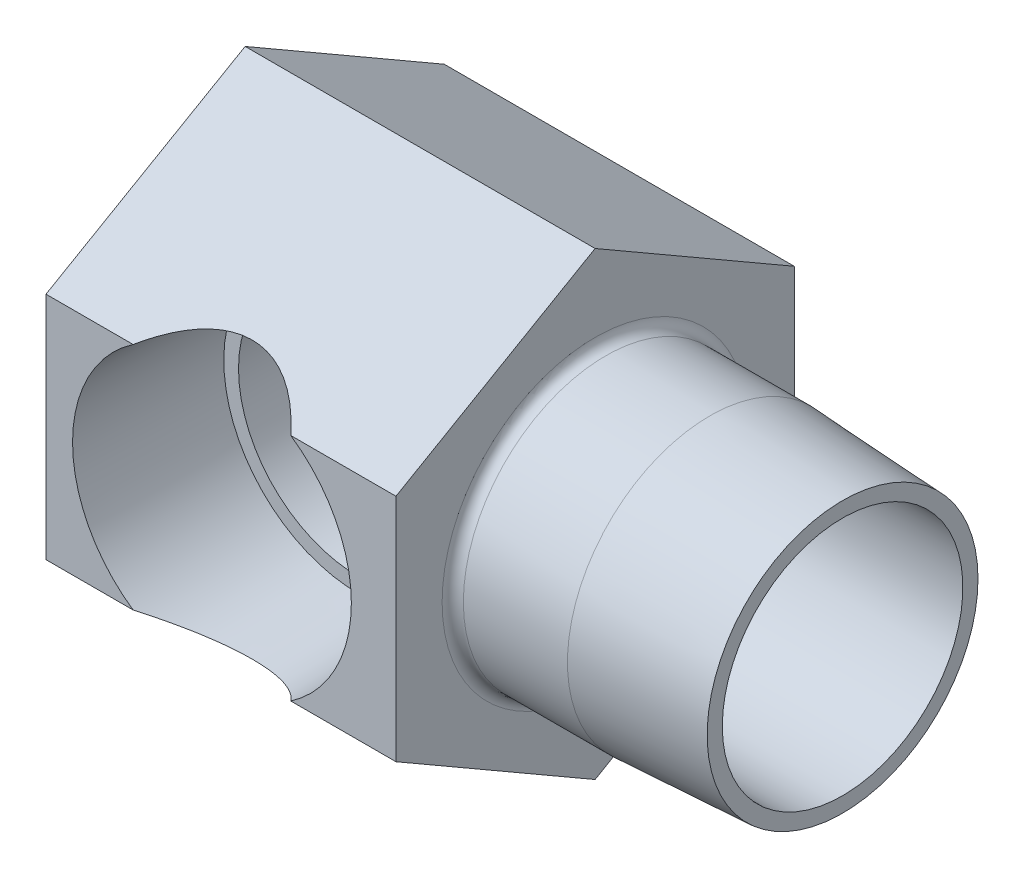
ISO-10303-21;
HEADER;
FILE_DESCRIPTION(('STEP AP214'),'2;1');
FILE_NAME('part.step','',(''),(''),'','','');
FILE_SCHEMA(('AUTOMOTIVE_DESIGN { 1 0 10303 214 1 1 1 1 }'));
ENDSEC;
DATA;
#1=APPLICATION_CONTEXT('core data for automotive mechanical design processes');
#2=APPLICATION_PROTOCOL_DEFINITION('international standard','automotive_design',2000,#1);
#3=PRODUCT_CONTEXT('',#1,'mechanical');
#4=PRODUCT('Part','Part','',(#3));
#5=PRODUCT_RELATED_PRODUCT_CATEGORY('part','',(#4));
#6=PRODUCT_DEFINITION_FORMATION('','',#4);
#7=PRODUCT_DEFINITION_CONTEXT('part definition',#1,'design');
#8=PRODUCT_DEFINITION('design','',#6,#7);
#9=PRODUCT_DEFINITION_SHAPE('','',#8);
#10=(LENGTH_UNIT() NAMED_UNIT(*) SI_UNIT(.MILLI.,.METRE.));
#11=(NAMED_UNIT(*) PLANE_ANGLE_UNIT() SI_UNIT($,.RADIAN.));
#12=(NAMED_UNIT(*) SI_UNIT($,.STERADIAN.) SOLID_ANGLE_UNIT());
#13=UNCERTAINTY_MEASURE_WITH_UNIT(LENGTH_MEASURE(1.E-05),#10,'distance_accuracy_value','');
#14=(GEOMETRIC_REPRESENTATION_CONTEXT(3) GLOBAL_UNCERTAINTY_ASSIGNED_CONTEXT((#13)) GLOBAL_UNIT_ASSIGNED_CONTEXT((#10,
#11,#12)) REPRESENTATION_CONTEXT('',''));
#15=CARTESIAN_POINT('',(0.,0.,0.));
#16=DIRECTION('',(0.,0.,1.));
#17=DIRECTION('',(1.,0.,0.));
#18=AXIS2_PLACEMENT_3D('',#15,#16,#17);
#19=CARTESIAN_POINT('',(-44.45,10.9985226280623,19.05));
#20=DIRECTION('',(0.,0.,1.));
#21=DIRECTION('',(0.,-1.,0.));
#22=AXIS2_PLACEMENT_3D('',#19,#20,#21);
#23=PLANE('',#22);
#24=CARTESIAN_POINT('',(-28.575,-1.20882374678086E-13,19.05));
#25=DIRECTION('',(0.,0.,1.));
#26=DIRECTION('',(0.,-1.,0.));
#27=AXIS2_PLACEMENT_3D('',#24,#25,#26);
#28=CIRCLE('',#27,13.3347714);
#29=CARTESIAN_POINT('',(-21.0351970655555,-10.9985226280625,19.05));
#30=VERTEX_POINT('',#29);
#31=CARTESIAN_POINT('',(-21.0351970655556,10.9985226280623,19.05));
#32=VERTEX_POINT('',#31);
#33=EDGE_CURVE('E255',#30,#32,#28,.T.);
#34=ORIENTED_EDGE('',*,*,#33,.F.);
#35=DIRECTION('',(1.,0.,0.));
#36=VECTOR('',#35,1.);
#37=CARTESIAN_POINT('',(-44.45,-10.9985226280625,19.05));
#38=LINE('',#37,#36);
#39=CARTESIAN_POINT('',(-10.9728,-10.9985226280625,19.05));
#40=VERTEX_POINT('',#39);
#41=EDGE_CURVE('E193',#30,#40,#38,.T.);
#42=ORIENTED_EDGE('',*,*,#41,.T.);
#43=DIRECTION('',(0.,-1.,0.));
#44=VECTOR('',#43,1.);
#45=CARTESIAN_POINT('',(-10.9728,10.9985226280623,19.05));
#46=LINE('',#45,#44);
#47=CARTESIAN_POINT('',(-10.9728,10.9985226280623,19.05));
#48=VERTEX_POINT('',#47);
#49=EDGE_CURVE('E220',#48,#40,#46,.T.);
#50=ORIENTED_EDGE('',*,*,#49,.F.);
#51=DIRECTION('',(1.,0.,0.));
#52=VECTOR('',#51,1.);
#53=CARTESIAN_POINT('',(-44.45,10.9985226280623,19.05));
#54=LINE('',#53,#52);
#55=EDGE_CURVE('E201',#32,#48,#54,.T.);
#56=ORIENTED_EDGE('',*,*,#55,.F.);
#57=EDGE_LOOP('',(#34,#42,#50,#56));
#58=FACE_BOUND('',#57,.T.);
#59=ADVANCED_FACE('F14',(#58),#23,.T.);
#60=CARTESIAN_POINT('',(-36.1148029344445,10.9985226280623,19.05));
#61=VERTEX_POINT('',#60);
#62=CARTESIAN_POINT('',(-36.1148029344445,-10.9985226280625,19.05));
#63=VERTEX_POINT('',#62);
#64=EDGE_CURVE('E37',#61,#63,#28,.T.);
#65=ORIENTED_EDGE('',*,*,#64,.F.);
#66=CARTESIAN_POINT('',(-44.45,10.9985226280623,19.05));
#67=VERTEX_POINT('',#66);
#68=EDGE_CURVE('E188',#67,#61,#54,.T.);
#69=ORIENTED_EDGE('',*,*,#68,.F.);
#70=DIRECTION('',(0.,-1.,0.));
#71=VECTOR('',#70,1.);
#72=CARTESIAN_POINT('',(-44.45,10.9985226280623,19.05));
#73=LINE('',#72,#71);
#74=CARTESIAN_POINT('',(-44.45,-10.9985226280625,19.05));
#75=VERTEX_POINT('',#74);
#76=EDGE_CURVE('E207',#67,#75,#73,.T.);
#77=ORIENTED_EDGE('',*,*,#76,.T.);
#78=EDGE_CURVE('E189',#75,#63,#38,.T.);
#79=ORIENTED_EDGE('',*,*,#78,.T.);
#80=EDGE_LOOP('',(#65,#69,#77,#79));
#81=FACE_BOUND('',#80,.T.);
#82=ADVANCED_FACE('F287',(#81),#23,.T.);
#83=CARTESIAN_POINT('',(-44.45,21.9970452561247,1.53604546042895E-13));
#84=DIRECTION('',(0.,0.866025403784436,0.500000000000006));
#85=DIRECTION('',(0.,-0.500000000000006,0.866025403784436));
#86=AXIS2_PLACEMENT_3D('',#83,#84,#85);
#87=PLANE('',#86);
#88=CARTESIAN_POINT('',(-28.575,-0.7230648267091,39.3523850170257));
#89=DIRECTION('',(0.,0.866025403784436,0.500000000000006));
#90=DIRECTION('',(0.,-0.500000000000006,0.866025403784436));
#91=AXIS2_PLACEMENT_3D('',#88,#89,#90);
#92=ELLIPSE('',#91,27.885303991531,13.9238903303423);
#93=EDGE_CURVE('E246',#32,#61,#92,.T.);
#94=ORIENTED_EDGE('',*,*,#93,.F.);
#95=ORIENTED_EDGE('',*,*,#55,.T.);
#96=DIRECTION('',(0.,-0.500000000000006,0.866025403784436));
#97=VECTOR('',#96,1.);
#98=CARTESIAN_POINT('',(-10.9728,21.9970452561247,1.53604546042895E-13));
#99=LINE('',#98,#97);
#100=CARTESIAN_POINT('',(-10.9728,21.9970452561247,1.53604546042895E-13));
#101=VERTEX_POINT('',#100);
#102=EDGE_CURVE('E204',#101,#48,#99,.T.);
#103=ORIENTED_EDGE('',*,*,#102,.F.);
#104=DIRECTION('',(1.,0.,0.));
#105=VECTOR('',#104,1.);
#106=CARTESIAN_POINT('',(-44.45,21.9970452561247,1.53604546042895E-13));
#107=LINE('',#106,#105);
#108=CARTESIAN_POINT('',(-44.45,21.9970452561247,1.53604546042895E-13));
#109=VERTEX_POINT('',#108);
#110=EDGE_CURVE('E199',#109,#101,#107,.T.);
#111=ORIENTED_EDGE('',*,*,#110,.F.);
#112=DIRECTION('',(0.,-0.500000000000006,0.866025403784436));
#113=VECTOR('',#112,1.);
#114=CARTESIAN_POINT('',(-44.45,21.9970452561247,1.53604546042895E-13));
#115=LINE('',#114,#113);
#116=EDGE_CURVE('E224',#109,#67,#115,.T.);
#117=ORIENTED_EDGE('',*,*,#116,.T.);
#118=ORIENTED_EDGE('',*,*,#68,.T.);
#119=EDGE_LOOP('',(#94,#95,#103,#111,#117,#118));
#120=FACE_BOUND('',#119,.T.);
#121=ADVANCED_FACE('F293',(#120),#87,.T.);
#122=CARTESIAN_POINT('',(-44.45,10.9985226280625,-19.05));
#123=DIRECTION('',(0.,0.866025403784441,-0.499999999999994));
#124=DIRECTION('',(0.,0.499999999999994,0.866025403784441));
#125=AXIS2_PLACEMENT_3D('',#122,#123,#124);
#126=PLANE('',#125);
#127=DIRECTION('',(0.,0.499999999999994,0.866025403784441));
#128=VECTOR('',#127,1.);
#129=CARTESIAN_POINT('',(-10.9728,10.9985226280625,-19.05));
#130=LINE('',#129,#128);
#131=CARTESIAN_POINT('',(-10.9728,10.9985226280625,-19.05));
#132=VERTEX_POINT('',#131);
#133=EDGE_CURVE('E208',#132,#101,#130,.T.);
#134=ORIENTED_EDGE('',*,*,#133,.F.);
#135=DIRECTION('',(1.,0.,0.));
#136=VECTOR('',#135,1.);
#137=CARTESIAN_POINT('',(-44.45,10.9985226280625,-19.05));
#138=LINE('',#137,#136);
#139=CARTESIAN_POINT('',(-44.45,10.9985226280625,-19.05));
#140=VERTEX_POINT('',#139);
#141=EDGE_CURVE('E197',#140,#132,#138,.T.);
#142=ORIENTED_EDGE('',*,*,#141,.F.);
#143=DIRECTION('',(0.,0.499999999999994,0.866025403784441));
#144=VECTOR('',#143,1.);
#145=CARTESIAN_POINT('',(-44.45,10.9985226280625,-19.05));
#146=LINE('',#145,#144);
#147=EDGE_CURVE('E227',#140,#109,#146,.T.);
#148=ORIENTED_EDGE('',*,*,#147,.T.);
#149=ORIENTED_EDGE('',*,*,#110,.T.);
#150=EDGE_LOOP('',(#134,#142,#148,#149));
#151=FACE_BOUND('',#150,.T.);
#152=ADVANCED_FACE('F309',(#151),#126,.T.);
#153=CARTESIAN_POINT('',(-44.45,-10.9985226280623,-19.05));
#154=DIRECTION('',(0.,0.,-1.));
#155=DIRECTION('',(0.,1.,0.));
#156=AXIS2_PLACEMENT_3D('',#153,#154,#155);
#157=PLANE('',#156);
#158=DIRECTION('',(0.,1.,0.));
#159=VECTOR('',#158,1.);
#160=CARTESIAN_POINT('',(-10.9728,-10.9985226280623,-19.05));
#161=LINE('',#160,#159);
#162=CARTESIAN_POINT('',(-10.9728,-10.9985226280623,-19.05));
#163=VERTEX_POINT('',#162);
#164=EDGE_CURVE('E211',#163,#132,#161,.T.);
#165=ORIENTED_EDGE('',*,*,#164,.F.);
#166=DIRECTION('',(1.,0.,0.));
#167=VECTOR('',#166,1.);
#168=CARTESIAN_POINT('',(-44.45,-10.9985226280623,-19.05));
#169=LINE('',#168,#167);
#170=CARTESIAN_POINT('',(-44.45,-10.9985226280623,-19.05));
#171=VERTEX_POINT('',#170);
#172=EDGE_CURVE('E195',#171,#163,#169,.T.);
#173=ORIENTED_EDGE('',*,*,#172,.F.);
#174=DIRECTION('',(0.,1.,0.));
#175=VECTOR('',#174,1.);
#176=CARTESIAN_POINT('',(-44.45,-10.9985226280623,-19.05));
#177=LINE('',#176,#175);
#178=EDGE_CURVE('E230',#171,#140,#177,.T.);
#179=ORIENTED_EDGE('',*,*,#178,.T.);
#180=ORIENTED_EDGE('',*,*,#141,.T.);
#181=EDGE_LOOP('',(#165,#173,#179,#180));
#182=FACE_BOUND('',#181,.T.);
#183=ADVANCED_FACE('F305',(#182),#157,.T.);
#184=CARTESIAN_POINT('',(-44.45,-21.9970452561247,-1.41461481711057E-13));
#185=DIRECTION('',(0.,-0.866025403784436,-0.500000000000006));
#186=DIRECTION('',(0.,0.500000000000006,-0.866025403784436));
#187=AXIS2_PLACEMENT_3D('',#184,#185,#186);
#188=PLANE('',#187);
#189=DIRECTION('',(0.,0.500000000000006,-0.866025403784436));
#190=VECTOR('',#189,1.);
#191=CARTESIAN_POINT('',(-10.9728,-21.9970452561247,-1.41461481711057E-13));
#192=LINE('',#191,#190);
#193=CARTESIAN_POINT('',(-10.9728,-21.9970452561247,-1.41461481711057E-13));
#194=VERTEX_POINT('',#193);
#195=EDGE_CURVE('E214',#194,#163,#192,.T.);
#196=ORIENTED_EDGE('',*,*,#195,.F.);
#197=DIRECTION('',(1.,0.,0.));
#198=VECTOR('',#197,1.);
#199=CARTESIAN_POINT('',(-44.45,-21.9970452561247,-1.41461481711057E-13));
#200=LINE('',#199,#198);
#201=CARTESIAN_POINT('',(-44.45,-21.9970452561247,-1.41461481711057E-13));
#202=VERTEX_POINT('',#201);
#203=EDGE_CURVE('E192',#202,#194,#200,.T.);
#204=ORIENTED_EDGE('',*,*,#203,.F.);
#205=DIRECTION('',(0.,0.500000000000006,-0.866025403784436));
#206=VECTOR('',#205,1.);
#207=CARTESIAN_POINT('',(-44.45,-21.9970452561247,-1.41461481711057E-13));
#208=LINE('',#207,#206);
#209=EDGE_CURVE('E233',#202,#171,#208,.T.);
#210=ORIENTED_EDGE('',*,*,#209,.T.);
#211=ORIENTED_EDGE('',*,*,#172,.T.);
#212=EDGE_LOOP('',(#196,#204,#210,#211));
#213=FACE_BOUND('',#212,.T.);
#214=ADVANCED_FACE('F301',(#213),#188,.T.);
#215=CARTESIAN_POINT('',(-44.45,-10.9985226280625,19.05));
#216=DIRECTION('',(0.,-0.866025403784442,0.499999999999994));
#217=DIRECTION('',(0.,-0.499999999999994,-0.866025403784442));
#218=AXIS2_PLACEMENT_3D('',#215,#216,#217);
#219=PLANE('',#218);
#220=CARTESIAN_POINT('',(-28.575,0.723064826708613,39.3523850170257));
#221=DIRECTION('',(0.,-0.866025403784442,0.499999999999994));
#222=DIRECTION('',(0.,0.499999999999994,0.866025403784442));
#223=AXIS2_PLACEMENT_3D('',#220,#221,#222);
#224=ELLIPSE('',#223,27.885303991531,13.9238903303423);
#225=EDGE_CURVE('E180',#63,#30,#224,.T.);
#226=ORIENTED_EDGE('',*,*,#225,.F.);
#227=ORIENTED_EDGE('',*,*,#78,.F.);
#228=DIRECTION('',(0.,-0.499999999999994,-0.866025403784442));
#229=VECTOR('',#228,1.);
#230=CARTESIAN_POINT('',(-44.45,-10.9985226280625,19.05));
#231=LINE('',#230,#229);
#232=EDGE_CURVE('E236',#75,#202,#231,.T.);
#233=ORIENTED_EDGE('',*,*,#232,.T.);
#234=ORIENTED_EDGE('',*,*,#203,.T.);
#235=DIRECTION('',(0.,-0.499999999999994,-0.866025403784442));
#236=VECTOR('',#235,1.);
#237=CARTESIAN_POINT('',(-10.9728,-10.9985226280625,19.05));
#238=LINE('',#237,#236);
#239=EDGE_CURVE('E217',#40,#194,#238,.T.);
#240=ORIENTED_EDGE('',*,*,#239,.F.);
#241=ORIENTED_EDGE('',*,*,#41,.F.);
#242=EDGE_LOOP('',(#226,#227,#233,#234,#240,#241));
#243=FACE_BOUND('',#242,.T.);
#244=ADVANCED_FACE('F297',(#243),#219,.T.);
#245=CARTESIAN_POINT('',(-44.45,0.,0.));
#246=DIRECTION('',(1.,0.,0.));
#247=DIRECTION('',(0.,0.,1.));
#248=AXIS2_PLACEMENT_3D('',#245,#246,#247);
#249=PLANE('',#248);
#250=ORIENTED_EDGE('',*,*,#76,.F.);
#251=ORIENTED_EDGE('',*,*,#116,.F.);
#252=ORIENTED_EDGE('',*,*,#147,.F.);
#253=ORIENTED_EDGE('',*,*,#178,.F.);
#254=ORIENTED_EDGE('',*,*,#209,.F.);
#255=ORIENTED_EDGE('',*,*,#232,.F.);
#256=EDGE_LOOP('',(#250,#251,#252,#253,#254,#255));
#257=FACE_BOUND('',#256,.T.);
#258=ADVANCED_FACE('F300',(#257),#249,.F.);
#259=CARTESIAN_POINT('',(-10.9728,0.,0.));
#260=DIRECTION('',(1.,0.,0.));
#261=DIRECTION('',(0.,0.,1.));
#262=AXIS2_PLACEMENT_3D('',#259,#260,#261);
#263=PLANE('',#262);
#264=CARTESIAN_POINT('',(-10.9728,0.,0.));
#265=DIRECTION('',(1.,0.,0.));
#266=DIRECTION('',(0.,0.,1.));
#267=AXIS2_PLACEMENT_3D('',#264,#265,#266);
#268=CIRCLE('',#267,14.6355787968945);
#269=CARTESIAN_POINT('',(-10.9728,-1.02199700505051E-13,14.6355787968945));
#270=VERTEX_POINT('',#269);
#271=EDGE_CURVE('E185',#270,#270,#268,.F.);
#272=ORIENTED_EDGE('',*,*,#271,.T.);
#273=EDGE_LOOP('',(#272));
#274=FACE_BOUND('',#273,.T.);
#275=ORIENTED_EDGE('',*,*,#49,.T.);
#276=ORIENTED_EDGE('',*,*,#239,.T.);
#277=ORIENTED_EDGE('',*,*,#195,.T.);
#278=ORIENTED_EDGE('',*,*,#164,.T.);
#279=ORIENTED_EDGE('',*,*,#133,.T.);
#280=ORIENTED_EDGE('',*,*,#102,.T.);
#281=EDGE_LOOP('',(#275,#276,#277,#278,#279,#280));
#282=FACE_BOUND('',#281,.T.);
#283=ADVANCED_FACE('F317',(#274,#282),#263,.T.);
#284=CARTESIAN_POINT('',(-10.9728,0.,0.));
#285=DIRECTION('',(-1.,0.,0.));
#286=DIRECTION('',(0.,0.,-1.));
#287=AXIS2_PLACEMENT_3D('',#284,#285,#286);
#288=CYLINDRICAL_SURFACE('',#287,13.6195787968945);
#289=CARTESIAN_POINT('',(-9.9568,0.,0.));
#290=DIRECTION('',(1.,0.,0.));
#291=DIRECTION('',(0.,0.,1.));
#292=AXIS2_PLACEMENT_3D('',#289,#290,#291);
#293=CIRCLE('',#292,13.6195787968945);
#294=CARTESIAN_POINT('',(-9.9568,0.,13.6195787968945));
#295=VERTEX_POINT('',#294);
#296=EDGE_CURVE('E182',#295,#295,#293,.T.);
#297=ORIENTED_EDGE('',*,*,#296,.T.);
#298=EDGE_LOOP('',(#297));
#299=FACE_BOUND('',#298,.T.);
#300=CARTESIAN_POINT('',(0.,0.,0.));
#301=DIRECTION('',(-1.,0.,0.));
#302=DIRECTION('',(0.,0.,-1.));
#303=AXIS2_PLACEMENT_3D('',#300,#301,#302);
#304=CIRCLE('',#303,13.6195787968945);
#305=CARTESIAN_POINT('',(0.,0.,-13.6195787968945));
#306=VERTEX_POINT('',#305);
#307=EDGE_CURVE('E223',#306,#306,#304,.T.);
#308=ORIENTED_EDGE('',*,*,#307,.T.);
#309=EDGE_LOOP('',(#308));
#310=FACE_BOUND('',#309,.T.);
#311=ADVANCED_FACE('F320',(#299,#310),#288,.T.);
#312=CARTESIAN_POINT('',(12.7,0.,0.));
#313=DIRECTION('',(-1.,0.,0.));
#314=DIRECTION('',(0.,0.,-1.));
#315=AXIS2_PLACEMENT_3D('',#312,#313,#314);
#316=CONICAL_SURFACE('',#315,12.954,0.052359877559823);
#317=ORIENTED_EDGE('',*,*,#307,.F.);
#318=EDGE_LOOP('',(#317));
#319=FACE_BOUND('',#318,.T.);
#320=CARTESIAN_POINT('',(12.7,0.,0.));
#321=DIRECTION('',(-1.,0.,0.));
#322=DIRECTION('',(0.,0.,-1.));
#323=AXIS2_PLACEMENT_3D('',#320,#321,#322);
#324=CIRCLE('',#323,12.954);
#325=CARTESIAN_POINT('',(12.7,0.,-12.954));
#326=VERTEX_POINT('',#325);
#327=EDGE_CURVE('E243',#326,#326,#324,.T.);
#328=ORIENTED_EDGE('',*,*,#327,.T.);
#329=EDGE_LOOP('',(#328));
#330=FACE_BOUND('',#329,.T.);
#331=ADVANCED_FACE('F327',(#319,#330),#316,.T.);
#332=CARTESIAN_POINT('',(12.7,-12.954,0.));
#333=DIRECTION('',(-1.,0.,0.));
#334=DIRECTION('',(0.,0.,-1.));
#335=AXIS2_PLACEMENT_3D('',#332,#333,#334);
#336=PLANE('',#335);
#337=CARTESIAN_POINT('',(12.7,0.,0.));
#338=DIRECTION('',(1.,0.,0.));
#339=DIRECTION('',(0.,0.,1.));
#340=AXIS2_PLACEMENT_3D('',#337,#338,#339);
#341=CIRCLE('',#340,11.5062);
#342=CARTESIAN_POINT('',(12.7,0.,11.5062));
#343=VERTEX_POINT('',#342);
#344=EDGE_CURVE('E269',#343,#343,#341,.T.);
#345=ORIENTED_EDGE('',*,*,#344,.F.);
#346=EDGE_LOOP('',(#345));
#347=FACE_BOUND('',#346,.T.);
#348=ORIENTED_EDGE('',*,*,#327,.F.);
#349=EDGE_LOOP('',(#348));
#350=FACE_BOUND('',#349,.T.);
#351=ADVANCED_FACE('F330',(#347,#350),#336,.F.);
#352=CARTESIAN_POINT('',(-9.9568,0.,0.));
#353=DIRECTION('',(1.,0.,0.));
#354=DIRECTION('',(0.,0.,1.));
#355=AXIS2_PLACEMENT_3D('',#352,#353,#354);
#356=TOROIDAL_SURFACE('',#355,14.6355787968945,1.016);
#357=ORIENTED_EDGE('',*,*,#296,.F.);
#358=EDGE_LOOP('',(#357));
#359=FACE_BOUND('',#358,.T.);
#360=ORIENTED_EDGE('',*,*,#271,.F.);
#361=EDGE_LOOP('',(#360));
#362=FACE_BOUND('',#361,.T.);
#363=ADVANCED_FACE('F16',(#359,#362),#356,.F.);
#364=CARTESIAN_POINT('',(-28.575,0.,-6.35));
#365=DIRECTION('',(0.,0.,1.));
#366=DIRECTION('',(0.,-1.,0.));
#367=AXIS2_PLACEMENT_3D('',#364,#365,#366);
#368=CONICAL_SURFACE('',#367,11.5062,1.02974425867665);
#369=CARTESIAN_POINT('',(-28.575,0.,-6.35));
#370=DIRECTION('',(0.,0.,1.));
#371=DIRECTION('',(0.,-1.,0.));
#372=AXIS2_PLACEMENT_3D('',#369,#370,#371);
#373=CIRCLE('',#372,11.5062);
#374=CARTESIAN_POINT('',(-22.225,9.59531856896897,-6.34999999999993));
#375=VERTEX_POINT('',#374);
#376=CARTESIAN_POINT('',(-22.225,-9.59531856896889,-6.35000000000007));
#377=VERTEX_POINT('',#376);
#378=EDGE_CURVE('E248',#375,#377,#373,.T.);
#379=ORIENTED_EDGE('',*,*,#378,.T.);
#380=CARTESIAN_POINT('',(-21.1905536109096,-9.91740803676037,-5.83418000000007));
#381=CARTESIAN_POINT('',(-21.4031475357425,-9.85477708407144,-5.94064609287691));
#382=CARTESIAN_POINT('',(-21.6153509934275,-9.79008843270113,-6.04668513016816));
#383=CARTESIAN_POINT('',(-22.0389714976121,-9.65655656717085,-6.25772676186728));
#384=CARTESIAN_POINT('',(-22.2503885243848,-9.5877132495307,-6.36272933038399));
#385=CARTESIAN_POINT('',(-22.6721605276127,-9.44592326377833,-6.57138195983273));
#386=CARTESIAN_POINT('',(-22.8825164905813,-9.37298174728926,-6.67503352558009));
#387=CARTESIAN_POINT('',(-23.3024656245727,-9.22294266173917,-6.88085630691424));
#388=CARTESIAN_POINT('',(-23.5120588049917,-9.14584514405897,-6.98302754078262));
#389=CARTESIAN_POINT('',(-23.9305702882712,-8.98762338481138,-7.18552471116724));
#390=CARTESIAN_POINT('',(-24.1394886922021,-8.90649977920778,-7.28585093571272));
#391=CARTESIAN_POINT('',(-24.556951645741,-8.74051741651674,-7.48416388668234));
#392=CARTESIAN_POINT('',(-24.7654961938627,-8.65565864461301,-7.58215060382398));
#393=CARTESIAN_POINT('',(-25.1830083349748,-8.48273536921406,-7.77512794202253));
#394=CARTESIAN_POINT('',(-25.3919761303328,-8.3946669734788,-7.87011464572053));
#395=CARTESIAN_POINT('',(-25.7063758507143,-8.2612870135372,-8.00923887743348));
#396=CARTESIAN_POINT('',(-25.8113357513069,-8.21661327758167,-8.05505515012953));
#397=CARTESIAN_POINT('',(-26.0218320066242,-8.12718774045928,-8.14527577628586));
#398=CARTESIAN_POINT('',(-26.1273683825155,-8.08243593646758,-8.18968007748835));
#399=CARTESIAN_POINT('',(-26.23332,-8.0378203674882,-8.23323036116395));
#400=B_SPLINE_CURVE_WITH_KNOTS('',3,(#380,#381,#382,#383,#384,#385,#386,#387,#388,#389,#390,
#391,#392,#393,#394,#395,#396,#397,#398,#399),.UNSPECIFIED.,.F.,.F.,(4,2,2,2,2,2,2,2,2,4),(0.,
0.737614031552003,1.47524644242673,2.21197150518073,2.94868746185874,3.68528741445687,
4.42189028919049,5.15941826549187,5.52819616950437,5.89698770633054),.UNSPECIFIED.);
#401=CARTESIAN_POINT('',(-25.4,-8.39106293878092,-7.87290932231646));
#402=VERTEX_POINT('',#401);
#403=EDGE_CURVE('E154',#377,#402,#400,.T.);
#404=ORIENTED_EDGE('',*,*,#403,.T.);
#405=CARTESIAN_POINT('',(-25.4,57.2412448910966,21.183254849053));
#406=CARTESIAN_POINT('',(-25.4,55.2682780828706,19.9996105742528));
#407=CARTESIAN_POINT('',(-25.4,53.2952404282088,18.8160843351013));
#408=CARTESIAN_POINT('',(-25.4,49.3489186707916,16.4494113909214));
#409=CARTESIAN_POINT('',(-25.4,47.3756345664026,15.266264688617));
#410=CARTESIAN_POINT('',(-25.4,43.4283551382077,12.9002785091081));
#411=CARTESIAN_POINT('',(-25.4,41.4543597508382,11.7174391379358));
#412=CARTESIAN_POINT('',(-25.4,37.505888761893,9.35259274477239));
#413=CARTESIAN_POINT('',(-25.4,35.531413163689,8.17058571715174));
#414=CARTESIAN_POINT('',(-25.4,31.5786283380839,5.80605921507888));
#415=CARTESIAN_POINT('',(-25.4,29.6003178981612,4.62354176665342));
#416=CARTESIAN_POINT('',(-25.4,26.6317673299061,2.8515355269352));
#417=CARTESIAN_POINT('',(-25.4,25.6420592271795,2.26115556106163));
#418=CARTESIAN_POINT('',(-25.4,23.6621408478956,1.08124238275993));
#419=CARTESIAN_POINT('',(-25.4,22.6719305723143,0.491709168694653));
#420=CARTESIAN_POINT('',(-25.4,20.6909090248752,-0.686047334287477));
#421=CARTESIAN_POINT('',(-25.4,19.7000978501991,-1.27427078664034));
#422=CARTESIAN_POINT('',(-25.4,17.7173539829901,-2.44884357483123));
#423=CARTESIAN_POINT('',(-25.4,16.7254212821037,-3.03519289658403));
#424=CARTESIAN_POINT('',(-25.4,15.2361482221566,-3.9123434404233));
#425=CARTESIAN_POINT('',(-25.4,14.73950387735,-4.20432611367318));
#426=CARTESIAN_POINT('',(-25.4,13.7455900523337,-4.78722522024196));
#427=CARTESIAN_POINT('',(-25.4,13.2483205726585,-5.07814165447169));
#428=CARTESIAN_POINT('',(-25.4,12.2529343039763,-5.65850790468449));
#429=CARTESIAN_POINT('',(-25.4,11.754817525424,-5.94795773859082));
#430=CARTESIAN_POINT('',(-25.4,10.7573820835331,-6.5247779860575));
#431=CARTESIAN_POINT('',(-25.4,10.2580634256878,-6.81214840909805));
#432=CARTESIAN_POINT('',(-25.4,9.54906250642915,-7.217247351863));
#433=CARTESIAN_POINT('',(-25.4,9.34011898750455,-7.33626873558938));
#434=CARTESIAN_POINT('',(-25.4,8.92185441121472,-7.57364768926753));
#435=CARTESIAN_POINT('',(-25.4,8.71253335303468,-7.69200525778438));
#436=CARTESIAN_POINT('',(-25.4,8.29342129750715,-7.92792301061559));
#437=CARTESIAN_POINT('',(-25.4,8.08363026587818,-8.04548313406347));
#438=CARTESIAN_POINT('',(-25.4,7.66349366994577,-8.27960828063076));
#439=CARTESIAN_POINT('',(-25.4,7.4531481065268,-8.3961733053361));
#440=CARTESIAN_POINT('',(-25.4,7.03159145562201,-8.62815782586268));
#441=CARTESIAN_POINT('',(-25.4,6.82037978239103,-8.74357625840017));
#442=CARTESIAN_POINT('',(-25.4,6.39709742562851,-8.97282661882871));
#443=CARTESIAN_POINT('',(-25.4,6.18502674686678,-9.08665855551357));
#444=CARTESIAN_POINT('',(-25.4,5.7598194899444,-9.31225343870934));
#445=CARTESIAN_POINT('',(-25.4,5.54668304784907,-9.42401664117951));
#446=CARTESIAN_POINT('',(-25.4,5.11900631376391,-9.64482138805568));
#447=CARTESIAN_POINT('',(-25.4,4.90446605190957,-9.75386299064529));
#448=CARTESIAN_POINT('',(-25.4,4.45298606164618,-9.97849388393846));
#449=CARTESIAN_POINT('',(-25.4,4.21586250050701,-10.0937150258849));
#450=CARTESIAN_POINT('',(-25.4,3.73855042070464,-10.3178671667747));
#451=CARTESIAN_POINT('',(-25.4,3.49836115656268,-10.4267965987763));
#452=CARTESIAN_POINT('',(-25.4,3.13492392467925,-10.5831316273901));
#453=CARTESIAN_POINT('',(-25.4,3.01320439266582,-10.6340853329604));
#454=CARTESIAN_POINT('',(-25.4,2.76857733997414,-10.7330470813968));
#455=CARTESIAN_POINT('',(-25.4,2.64566989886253,-10.7810553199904));
#456=CARTESIAN_POINT('',(-25.4,2.39854244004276,-10.8734145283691));
#457=CARTESIAN_POINT('',(-25.4,2.27432304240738,-10.9177671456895));
#458=CARTESIAN_POINT('',(-25.4,2.02432084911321,-11.0019760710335));
#459=CARTESIAN_POINT('',(-25.4,1.89853759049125,-11.0418310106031));
#460=CARTESIAN_POINT('',(-25.4,1.60467783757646,-11.1278793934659));
#461=CARTESIAN_POINT('',(-25.4,1.43598133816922,-11.1720031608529));
#462=CARTESIAN_POINT('',(-25.4,1.09583169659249,-11.2476846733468));
#463=CARTESIAN_POINT('',(-25.4,0.924380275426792,-11.2792499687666));
#464=CARTESIAN_POINT('',(-25.4,0.580614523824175,-11.3268323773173));
#465=CARTESIAN_POINT('',(-25.4,0.408317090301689,-11.3429677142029));
#466=CARTESIAN_POINT('',(-25.4,0.0629603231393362,-11.3583186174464));
#467=CARTESIAN_POINT('',(-25.4,-0.110098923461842,-11.3575360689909));
#468=CARTESIAN_POINT('',(-25.4,-0.455086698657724,-11.3391606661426));
#469=CARTESIAN_POINT('',(-25.4,-0.627016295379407,-11.321587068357));
#470=CARTESIAN_POINT('',(-25.4,-0.968691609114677,-11.2715675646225));
#471=CARTESIAN_POINT('',(-25.4,-1.13843669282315,-11.239117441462));
#472=CARTESIAN_POINT('',(-25.4,-1.39173855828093,-11.1811944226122));
#473=CARTESIAN_POINT('',(-25.4,-1.47636756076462,-11.1602186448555));
#474=CARTESIAN_POINT('',(-25.4,-1.64490789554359,-11.1155452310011));
#475=CARTESIAN_POINT('',(-25.4,-1.72881922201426,-11.0918475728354));
#476=CARTESIAN_POINT('',(-25.4,-1.89591857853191,-11.0420737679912));
#477=CARTESIAN_POINT('',(-25.4,-1.97910668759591,-11.015997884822));
#478=CARTESIAN_POINT('',(-25.4,-2.14479647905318,-10.9617727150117));
#479=CARTESIAN_POINT('',(-25.4,-2.22729819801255,-10.9336235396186));
#480=CARTESIAN_POINT('',(-25.4,-2.49909881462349,-10.8375638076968));
#481=CARTESIAN_POINT('',(-25.4,-2.68703009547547,-10.7657765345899));
#482=CARTESIAN_POINT('',(-25.4,-3.06013898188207,-10.6153347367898));
#483=CARTESIAN_POINT('',(-25.4,-3.24531578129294,-10.5366782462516));
#484=CARTESIAN_POINT('',(-25.4,-3.61362808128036,-10.3742838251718));
#485=CARTESIAN_POINT('',(-25.4,-3.7967614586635,-10.2905411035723));
#486=CARTESIAN_POINT('',(-25.4,-4.1612539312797,-10.1193492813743));
#487=CARTESIAN_POINT('',(-25.4,-4.34261321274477,-10.0319005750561));
#488=CARTESIAN_POINT('',(-25.4,-4.70445915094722,-9.85394468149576));
#489=CARTESIAN_POINT('',(-25.4,-4.88494187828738,-9.76342952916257));
#490=CARTESIAN_POINT('',(-25.4,-5.24480038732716,-9.58022127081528));
#491=CARTESIAN_POINT('',(-25.4,-5.42417614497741,-9.48752811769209));
#492=CARTESIAN_POINT('',(-25.4,-5.96078514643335,-9.2070233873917));
#493=CARTESIAN_POINT('',(-25.4,-6.31669768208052,-9.01668795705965));
#494=CARTESIAN_POINT('',(-25.4,-7.02771108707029,-8.63090733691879));
#495=CARTESIAN_POINT('',(-25.4,-7.38280187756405,-8.43544368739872));
#496=CARTESIAN_POINT('',(-25.4,-8.09139336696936,-8.04155248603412));
#497=CARTESIAN_POINT('',(-25.4,-8.44489385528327,-7.84312455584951));
#498=CARTESIAN_POINT('',(-25.4,-9.15008088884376,-7.44456294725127));
#499=CARTESIAN_POINT('',(-25.4,-9.50176956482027,-7.2444330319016));
#500=CARTESIAN_POINT('',(-25.4,-10.2042665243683,-6.84266991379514));
#501=CARTESIAN_POINT('',(-25.4,-10.5550748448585,-6.64103677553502));
#502=CARTESIAN_POINT('',(-25.4,-11.6086943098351,-6.03320967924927));
#503=CARTESIAN_POINT('',(-25.4,-12.3105281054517,-5.62532251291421));
#504=CARTESIAN_POINT('',(-25.4,-13.7126236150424,-4.80685341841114));
#505=CARTESIAN_POINT('',(-25.4,-14.4128853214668,-4.39627147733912));
#506=CARTESIAN_POINT('',(-25.4,-15.8123886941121,-3.57333033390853));
#507=CARTESIAN_POINT('',(-25.4,-16.5116303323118,-3.16097108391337));
#508=CARTESIAN_POINT('',(-25.4,-17.9093970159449,-2.33503953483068));
#509=CARTESIAN_POINT('',(-25.4,-18.6079220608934,-1.92146723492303));
#510=CARTESIAN_POINT('',(-25.4,-20.7039200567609,-0.678772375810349));
#511=CARTESIAN_POINT('',(-25.4,-22.1006334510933,0.151630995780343));
#512=CARTESIAN_POINT('',(-25.4,-24.892919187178,1.8143153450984));
#513=CARTESIAN_POINT('',(-25.4,-26.2884915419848,2.64659630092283));
#514=CARTESIAN_POINT('',(-25.4,-29.0355740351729,4.28646069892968));
#515=CARTESIAN_POINT('',(-25.4,-30.3871057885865,5.09400793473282));
#516=CARTESIAN_POINT('',(-25.4,-33.0897313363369,6.70984658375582));
#517=CARTESIAN_POINT('',(-25.4,-34.4408251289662,7.51813799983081));
#518=CARTESIAN_POINT('',(-25.4,-37.1415144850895,9.13452744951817));
#519=CARTESIAN_POINT('',(-25.4,-38.4911103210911,9.94262502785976));
#520=CARTESIAN_POINT('',(-25.4,-41.1900656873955,11.5592023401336));
#521=CARTESIAN_POINT('',(-25.4,-42.5394252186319,12.367682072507));
#522=CARTESIAN_POINT('',(-25.4,-43.888708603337,13.1762887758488));
#523=B_SPLINE_CURVE_WITH_KNOTS('',3,(#405,#406,#407,#408,#409,#410,#411,#412,#413,#414,#415,
#416,#417,#418,#419,#420,#421,#422,#423,#424,#425,#426,#427,#428,#429,#430,#431,#432,#433,#434,
#435,#436,#437,#438,#439,#440,#441,#442,#443,#444,#445,#446,#447,#448,#449,#450,#451,#452,#453,
#454,#455,#456,#457,#458,#459,#460,#461,#462,#463,#464,#465,#466,#467,#468,#469,#470,#471,#472,
#473,#474,#475,#476,#477,#478,#479,#480,#481,#482,#483,#484,#485,#486,#487,#488,#489,#490,#491,
#492,#493,#494,#495,#496,#497,#498,#499,#500,#501,#502,#503,#504,#505,#506,#507,#508,#509,#510,
#511,#512,#513,#514,#515,#516,#517,#518,#519,#520,#521,#522),.UNSPECIFIED.,.F.,.F.,(4,2,2,2,2,2,
2,2,2,2,2,2,2,2,2,2,2,2,2,2,2,2,2,2,2,2,2,2,2,2,2,2,2,2,2,2,2,2,2,2,2,2,2,2,2,2,2,2,2,2,2,2,2,2,
2,2,2,2,4),(0.,6.90235515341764,13.8047587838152,20.7085185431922,27.6122311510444,
34.5266018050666,37.9838599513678,41.4411114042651,44.8979041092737,48.354722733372,
50.0830694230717,51.8114146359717,53.5397386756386,55.2680548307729,55.989449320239,
56.7108453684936,57.4322958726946,58.153745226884,58.8758106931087,59.597872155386,
60.3198436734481,61.0417997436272,61.8326503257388,62.6236970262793,63.0195301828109,
63.4153370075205,63.8109644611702,64.2067119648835,64.7294459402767,65.2518651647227,
65.7702487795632,66.2885746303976,66.806306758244,67.3241857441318,67.5857196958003,
67.8472557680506,68.1087628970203,68.3702560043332,68.9735639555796,69.5770451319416,
70.1811038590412,70.7850984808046,71.390804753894,71.9965241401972,73.2073006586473,
74.4232859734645,75.6394278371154,76.8533556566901,78.0672316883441,80.5024781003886,
82.9377361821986,85.3730599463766,87.8083853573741,92.6831540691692,97.5578662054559,
102.281099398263,107.004350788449,111.723447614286,116.442525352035),.UNSPECIFIED.);
#524=CARTESIAN_POINT('',(-25.4,8.39106293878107,-7.87290932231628));
#525=VERTEX_POINT('',#524);
#526=EDGE_CURVE('E256',#525,#402,#523,.T.);
#527=ORIENTED_EDGE('',*,*,#526,.F.);
#528=CARTESIAN_POINT('',(-26.23332,8.03782036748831,-8.23323036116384));
#529=CARTESIAN_POINT('',(-26.1273683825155,8.08243593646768,-8.18968007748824));
#530=CARTESIAN_POINT('',(-26.0218320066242,8.12718774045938,-8.14527577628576));
#531=CARTESIAN_POINT('',(-25.8113357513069,8.21661327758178,-8.05505515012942));
#532=CARTESIAN_POINT('',(-25.7063758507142,8.2612870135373,-8.00923887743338));
#533=CARTESIAN_POINT('',(-25.3919761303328,8.3946669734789,-7.87011464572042));
#534=CARTESIAN_POINT('',(-25.1830083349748,8.48273536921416,-7.77512794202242));
#535=CARTESIAN_POINT('',(-24.7654961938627,8.6556586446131,-7.58215060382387));
#536=CARTESIAN_POINT('',(-24.556951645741,8.74051741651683,-7.48416388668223));
#537=CARTESIAN_POINT('',(-24.1394886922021,8.90649977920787,-7.2858509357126));
#538=CARTESIAN_POINT('',(-23.9305702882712,8.98762338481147,-7.18552471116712));
#539=CARTESIAN_POINT('',(-23.5120588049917,9.14584514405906,-6.98302754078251));
#540=CARTESIAN_POINT('',(-23.3024656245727,9.22294266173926,-6.88085630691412));
#541=CARTESIAN_POINT('',(-22.8825164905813,9.37298174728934,-6.67503352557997));
#542=CARTESIAN_POINT('',(-22.6721605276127,9.44592326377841,-6.57138195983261));
#543=CARTESIAN_POINT('',(-22.2503885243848,9.58771324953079,-6.36272933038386));
#544=CARTESIAN_POINT('',(-22.0389714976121,9.65655656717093,-6.25772676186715));
#545=CARTESIAN_POINT('',(-21.6153509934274,9.79008843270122,-6.04668513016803));
#546=CARTESIAN_POINT('',(-21.4031475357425,9.85477708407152,-5.94064609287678));
#547=CARTESIAN_POINT('',(-21.1905536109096,9.91740803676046,-5.83417999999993));
#548=B_SPLINE_CURVE_WITH_KNOTS('',3,(#528,#529,#530,#531,#532,#533,#534,#535,#536,#537,#538,
#539,#540,#541,#542,#543,#544,#545,#546,#547),.UNSPECIFIED.,.F.,.F.,(4,2,2,2,2,2,2,2,2,4),(0.,
0.368791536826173,0.737569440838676,1.47509741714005,2.21170029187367,2.9483002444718,
3.68501620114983,4.42174126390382,5.15937367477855,5.89698770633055),.UNSPECIFIED.);
#549=EDGE_CURVE('E146',#525,#375,#548,.T.);
#550=ORIENTED_EDGE('',*,*,#549,.T.);
#551=EDGE_LOOP('',(#379,#404,#527,#550));
#552=FACE_BOUND('',#551,.T.);
#553=CARTESIAN_POINT('',(-28.575,0.,-13.2636224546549));
#554=VERTEX_POINT('',#553);
#555=VERTEX_LOOP('',#554);
#556=FACE_BOUND('',#555,.T.);
#557=ADVANCED_FACE('F159',(#552,#556),#368,.F.);
#558=CARTESIAN_POINT('',(-28.575,-1.20882374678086E-13,19.05));
#559=DIRECTION('',(0.,0.,1.));
#560=DIRECTION('',(0.,-1.,0.));
#561=AXIS2_PLACEMENT_3D('',#558,#559,#560);
#562=CYLINDRICAL_SURFACE('',#561,11.5062);
#563=ORIENTED_EDGE('',*,*,#378,.F.);
#564=CARTESIAN_POINT('',(-28.575,0.,0.));
#565=DIRECTION('',(0.707106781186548,0.,0.707106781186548));
#566=DIRECTION('',(-0.707106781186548,0.,0.707106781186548));
#567=AXIS2_PLACEMENT_3D('',#564,#565,#566);
#568=ELLIPSE('',#567,16.2722240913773,11.5062);
#569=CARTESIAN_POINT('',(-25.4,11.059476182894,-3.17499999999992));
#570=VERTEX_POINT('',#569);
#571=EDGE_CURVE('E139',#375,#570,#568,.T.);
#572=ORIENTED_EDGE('',*,*,#571,.T.);
#573=DIRECTION('',(0.,0.,1.));
#574=VECTOR('',#573,1.);
#575=CARTESIAN_POINT('',(-25.4,11.0594761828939,19.05));
#576=LINE('',#575,#574);
#577=CARTESIAN_POINT('',(-25.4,11.059476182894,3.17500000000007));
#578=VERTEX_POINT('',#577);
#579=EDGE_CURVE('E9',#578,#570,#576,.F.);
#580=ORIENTED_EDGE('',*,*,#579,.F.);
#581=CARTESIAN_POINT('',(-28.575,0.,0.));
#582=DIRECTION('',(-0.707106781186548,0.,0.707106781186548));
#583=DIRECTION('',(0.707106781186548,0.,0.707106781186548));
#584=AXIS2_PLACEMENT_3D('',#581,#582,#583);
#585=ELLIPSE('',#584,16.2722240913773,11.5062);
#586=CARTESIAN_POINT('',(-23.5712,10.3612076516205,5.00380000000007));
#587=VERTEX_POINT('',#586);
#588=EDGE_CURVE('E136',#578,#587,#585,.F.);
#589=ORIENTED_EDGE('',*,*,#588,.T.);
#590=CARTESIAN_POINT('',(-28.575,0.,5.0038));
#591=DIRECTION('',(0.,0.,1.));
#592=DIRECTION('',(0.,-1.,0.));
#593=AXIS2_PLACEMENT_3D('',#590,#591,#592);
#594=CIRCLE('',#593,11.5062);
#595=CARTESIAN_POINT('',(-23.5712,-10.3612076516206,5.00379999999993));
#596=VERTEX_POINT('',#595);
#597=EDGE_CURVE('E135',#587,#596,#594,.T.);
#598=ORIENTED_EDGE('',*,*,#597,.T.);
#599=CARTESIAN_POINT('',(-25.4,-11.059476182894,3.17499999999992));
#600=VERTEX_POINT('',#599);
#601=EDGE_CURVE('E125',#596,#600,#585,.F.);
#602=ORIENTED_EDGE('',*,*,#601,.T.);
#603=DIRECTION('',(0.,0.,1.));
#604=VECTOR('',#603,1.);
#605=CARTESIAN_POINT('',(-25.4,-11.0594761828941,19.05));
#606=LINE('',#605,#604);
#607=CARTESIAN_POINT('',(-25.4,-11.059476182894,-3.17500000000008));
#608=VERTEX_POINT('',#607);
#609=EDGE_CURVE('E22',#608,#600,#606,.T.);
#610=ORIENTED_EDGE('',*,*,#609,.F.);
#611=EDGE_CURVE('E126',#608,#377,#568,.T.);
#612=ORIENTED_EDGE('',*,*,#611,.T.);
#613=EDGE_LOOP('',(#563,#572,#580,#589,#598,#602,#610,#612));
#614=FACE_BOUND('',#613,.T.);
#615=ADVANCED_FACE('F132',(#614),#562,.F.);
#616=CARTESIAN_POINT('',(-17.0688,0.,5.0038));
#617=DIRECTION('',(0.,0.,-1.));
#618=DIRECTION('',(0.,1.,0.));
#619=AXIS2_PLACEMENT_3D('',#616,#617,#618);
#620=PLANE('',#619);
#621=ORIENTED_EDGE('',*,*,#597,.F.);
#622=DIRECTION('',(1.,0.,0.));
#623=VECTOR('',#622,1.);
#624=CARTESIAN_POINT('',(-25.4,10.3612076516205,5.00380000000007));
#625=LINE('',#624,#623);
#626=CARTESIAN_POINT('',(-20.8664216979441,10.3612076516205,5.00380000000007));
#627=VERTEX_POINT('',#626);
#628=EDGE_CURVE('E137',#587,#627,#625,.T.);
#629=ORIENTED_EDGE('',*,*,#628,.T.);
#630=CARTESIAN_POINT('',(-28.575,0.,5.0038));
#631=DIRECTION('',(0.,0.,1.));
#632=DIRECTION('',(0.,-1.,0.));
#633=AXIS2_PLACEMENT_3D('',#630,#631,#632);
#634=CIRCLE('',#633,12.9142093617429);
#635=CARTESIAN_POINT('',(-20.8664216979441,-10.3612076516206,5.00379999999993));
#636=VERTEX_POINT('',#635);
#637=EDGE_CURVE('E252',#627,#636,#634,.T.);
#638=ORIENTED_EDGE('',*,*,#637,.T.);
#639=DIRECTION('',(1.,0.,0.));
#640=VECTOR('',#639,1.);
#641=CARTESIAN_POINT('',(-25.4,-10.3612076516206,5.00379999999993));
#642=LINE('',#641,#640);
#643=EDGE_CURVE('E29',#636,#596,#642,.F.);
#644=ORIENTED_EDGE('',*,*,#643,.T.);
#645=EDGE_LOOP('',(#621,#629,#638,#644));
#646=FACE_BOUND('',#645,.T.);
#647=ADVANCED_FACE('F273',(#646),#620,.F.);
#648=CARTESIAN_POINT('',(-28.575,-1.20882374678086E-13,19.05));
#649=DIRECTION('',(0.,0.,1.));
#650=DIRECTION('',(0.,-1.,0.));
#651=AXIS2_PLACEMENT_3D('',#648,#649,#650);
#652=CONICAL_SURFACE('',#651,13.3347714,0.0299323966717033);
#653=ORIENTED_EDGE('',*,*,#93,.T.);
#654=ORIENTED_EDGE('',*,*,#64,.T.);
#655=ORIENTED_EDGE('',*,*,#225,.T.);
#656=ORIENTED_EDGE('',*,*,#33,.T.);
#657=EDGE_LOOP('',(#653,#654,#655,#656));
#658=FACE_BOUND('',#657,.T.);
#659=ORIENTED_EDGE('',*,*,#637,.F.);
#660=CARTESIAN_POINT('',(-20.8665615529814,10.3613042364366,5.00360000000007));
#661=CARTESIAN_POINT('',(-20.7367168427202,10.2716488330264,5.18920252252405));
#662=CARTESIAN_POINT('',(-20.6057038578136,10.1773747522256,5.37173696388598));
#663=CARTESIAN_POINT('',(-20.3424827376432,9.97958731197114,5.73084985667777));
#664=CARTESIAN_POINT('',(-20.2102745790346,9.87607377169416,5.90742819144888));
#665=CARTESIAN_POINT('',(-19.9455190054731,9.65957129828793,6.25518359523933));
#666=CARTESIAN_POINT('',(-19.8129714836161,9.54656203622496,6.42634793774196));
#667=CARTESIAN_POINT('',(-19.548791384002,9.31121606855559,6.76284304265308));
#668=CARTESIAN_POINT('',(-19.4171588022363,9.18887940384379,6.92817383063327));
#669=CARTESIAN_POINT('',(-19.0220718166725,8.80493947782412,7.41886522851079));
#670=CARTESIAN_POINT('',(-18.7613204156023,8.528733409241,7.73517291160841));
#671=CARTESIAN_POINT('',(-18.2541602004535,7.93721497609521,8.34099261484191));
#672=CARTESIAN_POINT('',(-18.007735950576,7.6219458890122,8.63053367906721));
#673=CARTESIAN_POINT('',(-17.6231477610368,7.07570863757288,9.07752089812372));
#674=CARTESIAN_POINT('',(-17.4786563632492,6.85669614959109,9.2442113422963));
#675=CARTESIAN_POINT('',(-17.1997734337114,6.40290636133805,9.5641244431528));
#676=CARTESIAN_POINT('',(-17.0653813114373,6.16812998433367,9.71734788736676));
#677=CARTESIAN_POINT('',(-16.8091528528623,5.68408527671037,10.008157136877));
#678=CARTESIAN_POINT('',(-16.6872684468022,5.43487866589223,10.1458030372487));
#679=CARTESIAN_POINT('',(-16.457467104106,4.92176645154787,10.4043905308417));
#680=CARTESIAN_POINT('',(-16.3495479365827,4.65786320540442,10.5253347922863));
#681=CARTESIAN_POINT('',(-16.1660603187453,4.16068507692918,10.7303948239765));
#682=CARTESIAN_POINT('',(-16.0880868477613,3.92944573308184,10.817299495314));
#683=CARTESIAN_POINT('',(-15.944557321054,3.45840518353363,10.9769706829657));
#684=CARTESIAN_POINT('',(-15.8789988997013,3.21860561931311,11.0497398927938));
#685=CARTESIAN_POINT('',(-15.7613933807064,2.73159397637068,11.1800976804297));
#686=CARTESIAN_POINT('',(-15.7093493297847,2.48438024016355,11.237682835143));
#687=CARTESIAN_POINT('',(-15.6197692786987,1.98413272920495,11.3367041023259));
#688=CARTESIAN_POINT('',(-15.5822334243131,1.73109889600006,11.3781400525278));
#689=CARTESIAN_POINT('',(-15.5223029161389,1.21993273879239,11.444260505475));
#690=CARTESIAN_POINT('',(-15.4999746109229,0.961783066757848,11.4688716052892));
#691=CARTESIAN_POINT('',(-15.4712034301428,0.44352177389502,11.5005792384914));
#692=CARTESIAN_POINT('',(-15.4647605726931,0.183410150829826,11.5076757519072));
#693=CARTESIAN_POINT('',(-15.4679021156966,-0.336554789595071,11.5042146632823));
#694=CARTESIAN_POINT('',(-15.4774839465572,-0.596408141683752,11.4936598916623));
#695=CARTESIAN_POINT('',(-15.5124596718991,-1.11373270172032,11.4551085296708));
#696=CARTESIAN_POINT('',(-15.5378530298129,-1.37120399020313,11.4271125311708));
#697=CARTESIAN_POINT('',(-15.6014831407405,-1.863020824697,11.3568883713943));
#698=CARTESIAN_POINT('',(-15.6386427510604,-2.09767875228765,11.315853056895));
#699=CARTESIAN_POINT('',(-15.725420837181,-2.56176158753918,11.219900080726));
#700=CARTESIAN_POINT('',(-15.7750383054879,-2.79118691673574,11.1649835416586));
#701=CARTESIAN_POINT('',(-15.8859379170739,-3.24361519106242,11.0420360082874));
#702=CARTESIAN_POINT('',(-15.9472209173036,-3.46661766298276,10.9740040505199));
#703=CARTESIAN_POINT('',(-16.0805501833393,-3.90522195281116,10.8256871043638));
#704=CARTESIAN_POINT('',(-16.1525985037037,-4.12082234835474,10.7453997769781));
#705=CARTESIAN_POINT('',(-16.3317265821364,-4.61316417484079,10.5452933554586));
#706=CARTESIAN_POINT('',(-16.4425499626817,-4.88679466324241,10.4211405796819));
#707=CARTESIAN_POINT('',(-16.6792075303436,-5.41839126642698,10.1549060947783));
#708=CARTESIAN_POINT('',(-16.8050457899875,-5.67635310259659,10.0128195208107));
#709=CARTESIAN_POINT('',(-17.0697739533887,-6.1764015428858,9.71236137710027));
#710=CARTESIAN_POINT('',(-17.2086909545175,-6.41845334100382,9.55395592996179));
#711=CARTESIAN_POINT('',(-17.4972142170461,-6.88575201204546,9.22285619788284));
#712=CARTESIAN_POINT('',(-17.6468205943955,-7.1109987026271,9.05016175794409));
#713=CARTESIAN_POINT('',(-18.0041584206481,-7.61426015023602,8.63444899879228));
#714=CARTESIAN_POINT('',(-18.2151410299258,-7.88602465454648,8.38664212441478));
#715=CARTESIAN_POINT('',(-18.6480393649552,-8.40060254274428,7.87116610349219));
#716=CARTESIAN_POINT('',(-18.8699602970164,-8.64340194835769,7.60348746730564));
#717=CARTESIAN_POINT('',(-19.3201088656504,-9.10015740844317,7.05040809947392));
#718=CARTESIAN_POINT('',(-19.548327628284,-9.314151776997,6.76503166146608));
#719=CARTESIAN_POINT('',(-20.0067633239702,-9.71405923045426,6.17706011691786));
#720=CARTESIAN_POINT('',(-20.2369788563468,-9.89999054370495,5.87447636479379));
#721=CARTESIAN_POINT('',(-20.5327618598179,-10.1226521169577,5.47133514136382));
#722=CARTESIAN_POINT('',(-20.599920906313,-10.1721125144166,5.37882849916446));
#723=CARTESIAN_POINT('',(-20.7336792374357,-10.2685496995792,5.19235317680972));
#724=CARTESIAN_POINT('',(-20.8002791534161,-10.3155297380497,5.09838663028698));
#725=CARTESIAN_POINT('',(-20.8665615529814,-10.3613042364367,5.00359999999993));
#726=B_SPLINE_CURVE_WITH_KNOTS('',3,(#660,#661,#662,#663,#664,#665,#666,#667,#668,#669,#670,
#671,#672,#673,#674,#675,#676,#677,#678,#679,#680,#681,#682,#683,#684,#685,#686,#687,#688,#689,
#690,#691,#692,#693,#694,#695,#696,#697,#698,#699,#700,#701,#702,#703,#704,#705,#706,#707,#708,
#709,#710,#711,#712,#713,#714,#715,#716,#717,#718,#719,#720,#721,#722,#723,#724,#725),
.UNSPECIFIED.,.F.,.F.,(4,2,2,2,2,2,2,2,2,2,2,2,2,2,2,2,2,2,2,2,2,2,2,2,2,2,2,2,2,2,2,2,4),(0.,
0.730742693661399,1.46149969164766,2.19386306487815,2.92622322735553,4.40671794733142,
5.88558686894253,6.81740652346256,7.74917165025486,8.67720996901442,9.60509985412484,
10.3814708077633,11.1576936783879,11.9340913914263,12.7104969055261,13.4902684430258,
14.2700408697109,15.0496882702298,15.8293092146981,16.5518175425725,17.2742674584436,
17.9967704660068,18.719411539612,19.6788090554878,20.6384673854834,21.6001596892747,
22.5618624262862,23.832053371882,25.1028548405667,26.3719489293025,27.6402150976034,
28.0138588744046,28.3870001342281),.UNSPECIFIED.);
#727=EDGE_CURVE('E123',#627,#636,#726,.T.);
#728=ORIENTED_EDGE('',*,*,#727,.T.);
#729=EDGE_LOOP('',(#659,#728));
#730=FACE_BOUND('',#729,.T.);
#731=ADVANCED_FACE('F170',(#658,#730),#652,.F.);
#732=CARTESIAN_POINT('',(-25.4,0.,0.));
#733=DIRECTION('',(1.,0.,0.));
#734=DIRECTION('',(0.,0.,1.));
#735=AXIS2_PLACEMENT_3D('',#732,#733,#734);
#736=PLANE('',#735);
#737=ORIENTED_EDGE('',*,*,#526,.T.);
#738=CARTESIAN_POINT('',(-25.4,0.,0.));
#739=DIRECTION('',(1.,0.,0.));
#740=DIRECTION('',(0.,0.,1.));
#741=AXIS2_PLACEMENT_3D('',#738,#739,#740);
#742=CIRCLE('',#741,11.5062);
#743=EDGE_CURVE('E127',#402,#525,#742,.T.);
#744=ORIENTED_EDGE('',*,*,#743,.T.);
#745=EDGE_LOOP('',(#737,#744));
#746=FACE_BOUND('',#745,.T.);
#747=ADVANCED_FACE('F168',(#746),#736,.T.);
#748=ORIENTED_EDGE('',*,*,#579,.T.);
#749=EDGE_CURVE('E129',#570,#578,#742,.T.);
#750=ORIENTED_EDGE('',*,*,#749,.T.);
#751=EDGE_LOOP('',(#748,#750));
#752=FACE_BOUND('',#751,.T.);
#753=ADVANCED_FACE('F278',(#752),#736,.T.);
#754=ORIENTED_EDGE('',*,*,#609,.T.);
#755=EDGE_CURVE('E119',#600,#608,#742,.T.);
#756=ORIENTED_EDGE('',*,*,#755,.T.);
#757=EDGE_LOOP('',(#754,#756));
#758=FACE_BOUND('',#757,.T.);
#759=ADVANCED_FACE('F118',(#758),#736,.T.);
#760=CARTESIAN_POINT('',(-25.4,0.,0.));
#761=DIRECTION('',(1.,0.,0.));
#762=DIRECTION('',(0.,0.,1.));
#763=AXIS2_PLACEMENT_3D('',#760,#761,#762);
#764=CYLINDRICAL_SURFACE('',#763,11.5062);
#765=ORIENTED_EDGE('',*,*,#344,.T.);
#766=EDGE_LOOP('',(#765));
#767=FACE_BOUND('',#766,.T.);
#768=ORIENTED_EDGE('',*,*,#611,.F.);
#769=ORIENTED_EDGE('',*,*,#755,.F.);
#770=ORIENTED_EDGE('',*,*,#601,.F.);
#771=ORIENTED_EDGE('',*,*,#643,.F.);
#772=ORIENTED_EDGE('',*,*,#727,.F.);
#773=ORIENTED_EDGE('',*,*,#628,.F.);
#774=ORIENTED_EDGE('',*,*,#588,.F.);
#775=ORIENTED_EDGE('',*,*,#749,.F.);
#776=ORIENTED_EDGE('',*,*,#571,.F.);
#777=ORIENTED_EDGE('',*,*,#549,.F.);
#778=ORIENTED_EDGE('',*,*,#743,.F.);
#779=ORIENTED_EDGE('',*,*,#403,.F.);
#780=EDGE_LOOP('',(#768,#769,#770,#771,#772,#773,#774,#775,#776,#777,#778,#779));
#781=FACE_BOUND('',#780,.T.);
#782=ADVANCED_FACE('F124',(#767,#781),#764,.F.);
#783=CLOSED_SHELL('',(#59,#82,#121,#152,#183,#214,#244,#258,#283,#311,#331,#351,#363,#557,#615,
#647,#731,#747,#753,#759,#782));
#784=MANIFOLD_SOLID_BREP('B1',#783);
#785=ADVANCED_BREP_SHAPE_REPRESENTATION('',(#18,#784),#14);
#786=SHAPE_DEFINITION_REPRESENTATION(#9,#785);
ENDSEC;
END-ISO-10303-21;
